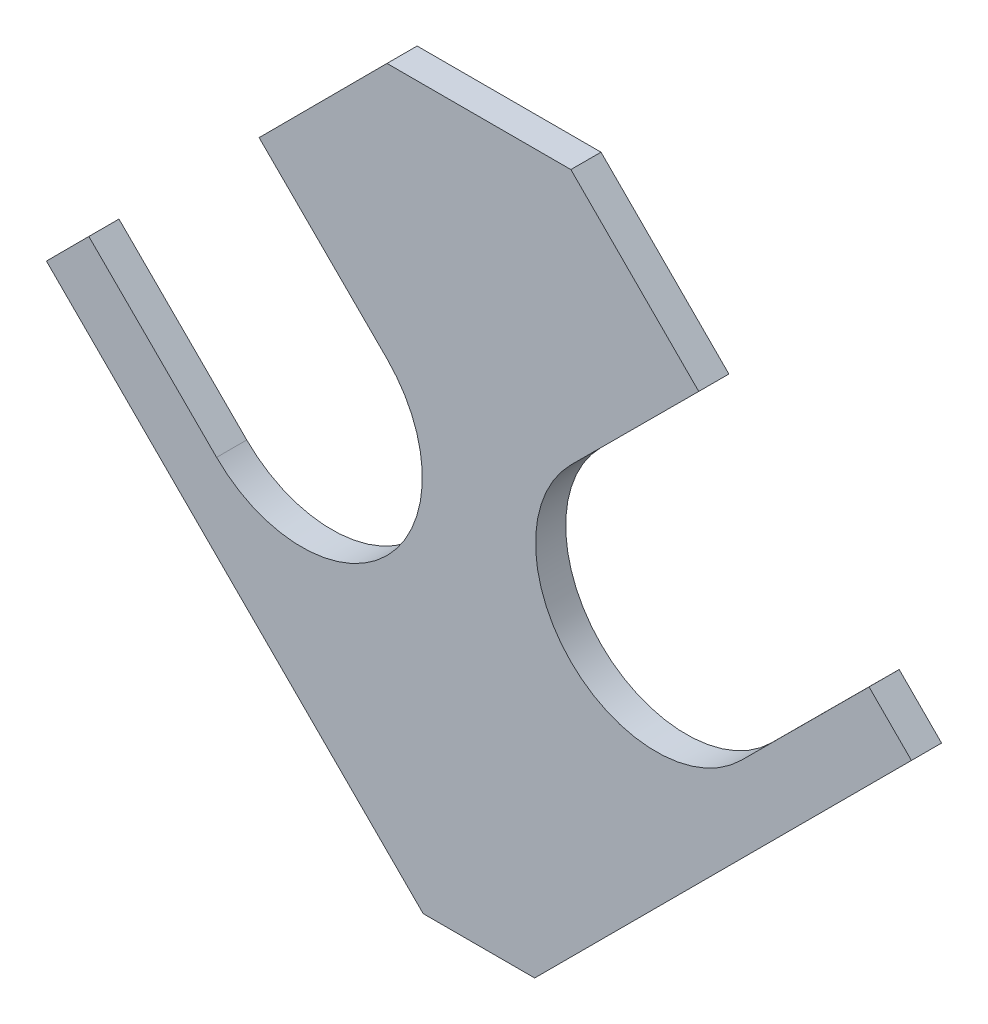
from build123d import *

# Parameters (mm, degrees)
SKETCH1_R          = 50.8
EXTRUDE1_DEPTH     = 12.7
CUT_EXTRUDE1_REACH = 375.787


with BuildPart() as part:
    # Sketch1 → Extrude1 (new body)
    with BuildSketch(Plane.XY):
        Polygon((-23.485378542, 23.485378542), (23.485378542, 23.485378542), (182.235378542, 182.235378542), (38.738207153, 326.106403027), (-38.738207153, 326.106403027), (-182.235378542, 182.235378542), align=None)
        with Locations((-74.659231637, 182.42230509)):
            Circle(SKETCH1_R, mode=Mode.SUBTRACT)
        with Locations((74.659231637, 182.42230509)):
            Circle(SKETCH1_R, mode=Mode.SUBTRACT)
    extrude(amount=EXTRUDE1_DEPTH)

    # Sketch2 → Cut-Extrude1 (cut, up to next)
    with BuildSketch(Plane.XY.offset(12.7), mode=Mode.PRIVATE) as cut_extrude1_sk1:
        with BuildLine():
            Line((38.784969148, 218.390030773), (92.619531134, 272.084702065))
            Line((92.619531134, 272.084702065), (164.368056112, 200.149250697))
            Line((164.368056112, 200.149250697), (110.533494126, 146.454579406))
            ThreePointArc((110.533494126, 146.454579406), (110.62695732, 218.296567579), (38.784969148, 218.390030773))
        make_face()
    cut_extrude1_tool1 = extrude(cut_extrude1_sk1.sketch, amount=-CUT_EXTRUDE1_REACH, mode=Mode.PRIVATE) & part.part
    # Sketch2 → Cut-Extrude1 (cut, up to next)
    with BuildSketch(Plane.XY.offset(12.7), mode=Mode.PRIVATE) as cut_extrude1_sk2:
        with BuildLine():
            Line((-110.533494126, 146.454579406), (-164.368056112, 200.149250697))
            Line((-164.368056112, 200.149250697), (-92.619531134, 272.084702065))
            Line((-92.619531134, 272.084702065), (-38.784969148, 218.390030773))
            ThreePointArc((-38.784969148, 218.390030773), (-110.62695732, 218.296567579), (-110.533494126, 146.454579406))
        make_face()
    cut_extrude1_tool2 = extrude(cut_extrude1_sk2.sketch, amount=-CUT_EXTRUDE1_REACH, mode=Mode.PRIVATE) & part.part
    add(cut_extrude1_tool1.solids().sort_by_distance((114.441578, 222.101276, 12.7))[0], mode=Mode.SUBTRACT)
    add(cut_extrude1_tool2.solids().sort_by_distance((-114.441578, 222.101276, 12.7))[0], mode=Mode.SUBTRACT)


solid = part.part
